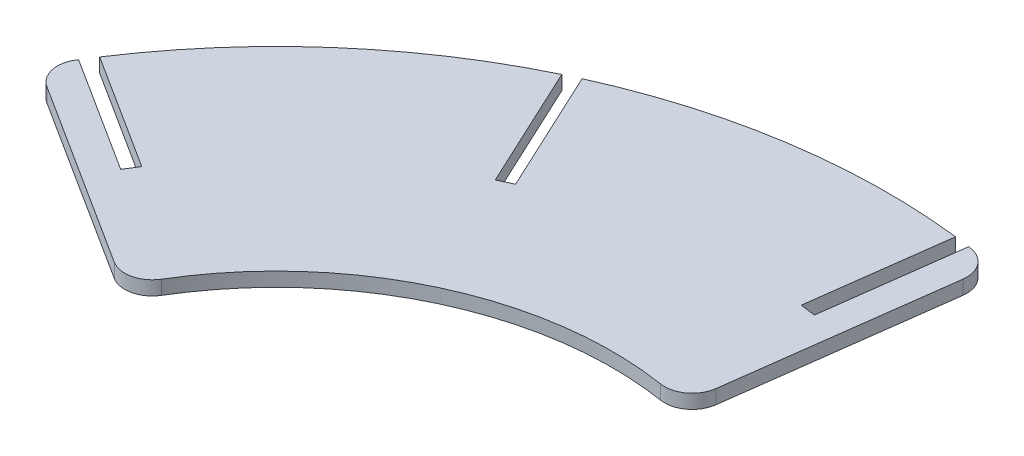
ISO-10303-21;
HEADER;
FILE_DESCRIPTION(('STEP AP214'),'2;1');
FILE_NAME('part.step','',(''),(''),'','','');
FILE_SCHEMA(('AUTOMOTIVE_DESIGN { 1 0 10303 214 1 1 1 1 }'));
ENDSEC;
DATA;
#1=APPLICATION_CONTEXT('core data for automotive mechanical design processes');
#2=APPLICATION_PROTOCOL_DEFINITION('international standard','automotive_design',2000,#1);
#3=PRODUCT_CONTEXT('',#1,'mechanical');
#4=PRODUCT('Part','Part','',(#3));
#5=PRODUCT_RELATED_PRODUCT_CATEGORY('part','',(#4));
#6=PRODUCT_DEFINITION_FORMATION('','',#4);
#7=PRODUCT_DEFINITION_CONTEXT('part definition',#1,'design');
#8=PRODUCT_DEFINITION('design','',#6,#7);
#9=PRODUCT_DEFINITION_SHAPE('','',#8);
#10=(LENGTH_UNIT() NAMED_UNIT(*) SI_UNIT(.MILLI.,.METRE.));
#11=(NAMED_UNIT(*) PLANE_ANGLE_UNIT() SI_UNIT($,.RADIAN.));
#12=(NAMED_UNIT(*) SI_UNIT($,.STERADIAN.) SOLID_ANGLE_UNIT());
#13=UNCERTAINTY_MEASURE_WITH_UNIT(LENGTH_MEASURE(1.E-05),#10,'distance_accuracy_value','');
#14=(GEOMETRIC_REPRESENTATION_CONTEXT(3) GLOBAL_UNCERTAINTY_ASSIGNED_CONTEXT((#13)) GLOBAL_UNIT_ASSIGNED_CONTEXT((#10,
#11,#12)) REPRESENTATION_CONTEXT('',''));
#15=CARTESIAN_POINT('',(0.,0.,0.));
#16=DIRECTION('',(0.,0.,1.));
#17=DIRECTION('',(1.,0.,0.));
#18=AXIS2_PLACEMENT_3D('',#15,#16,#17);
#19=CARTESIAN_POINT('',(-205.439804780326,23.,322.475898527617));
#20=DIRECTION('',(-0.537299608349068,0.,0.843391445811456));
#21=DIRECTION('',(0.843391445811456,0.,0.537299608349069));
#22=AXIS2_PLACEMENT_3D('',#19,#20,#21);
#23=PLANE('',#22);
#24=DIRECTION('',(-0.843391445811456,0.,-0.537299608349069));
#25=VECTOR('',#24,1.);
#26=CARTESIAN_POINT('',(-205.439804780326,0.,322.475898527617));
#27=LINE('',#26,#25);
#28=CARTESIAN_POINT('',(-683.022919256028,0.,18.2218992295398));
#29=VERTEX_POINT('',#28);
#30=CARTESIAN_POINT('',(-872.792066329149,0.,-102.674380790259));
#31=VERTEX_POINT('',#30);
#32=EDGE_CURVE('E189',#29,#31,#27,.T.);
#33=ORIENTED_EDGE('',*,*,#32,.T.);
#34=DIRECTION('',(0.,-1.,0.));
#35=VECTOR('',#34,1.);
#36=CARTESIAN_POINT('',(-872.792066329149,23.,-102.674380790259));
#37=LINE('',#36,#35);
#38=CARTESIAN_POINT('',(-872.792066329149,23.,-102.674380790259));
#39=VERTEX_POINT('',#38);
#40=EDGE_CURVE('E173',#39,#31,#37,.T.);
#41=ORIENTED_EDGE('',*,*,#40,.F.);
#42=DIRECTION('',(-0.843391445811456,0.,-0.537299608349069));
#43=VECTOR('',#42,1.);
#44=CARTESIAN_POINT('',(-205.439804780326,23.,322.475898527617));
#45=LINE('',#44,#43);
#46=CARTESIAN_POINT('',(-683.022919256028,23.,18.2218992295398));
#47=VERTEX_POINT('',#46);
#48=EDGE_CURVE('E176',#47,#39,#45,.T.);
#49=ORIENTED_EDGE('',*,*,#48,.F.);
#50=DIRECTION('',(0.,-1.,0.));
#51=VECTOR('',#50,1.);
#52=CARTESIAN_POINT('',(-683.022919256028,23.,18.2218992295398));
#53=LINE('',#52,#51);
#54=EDGE_CURVE('E289',#47,#29,#53,.T.);
#55=ORIENTED_EDGE('',*,*,#54,.T.);
#56=EDGE_LOOP('',(#33,#41,#49,#55));
#57=FACE_BOUND('',#56,.T.);
#58=ADVANCED_FACE('F34',(#57),#23,.F.);
#59=CARTESIAN_POINT('',(-22.750267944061,23.,424.040856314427));
#60=DIRECTION('',(0.,-1.,0.));
#61=DIRECTION('',(0.,0.,-1.));
#62=AXIS2_PLACEMENT_3D('',#59,#60,#61);
#63=CYLINDRICAL_SURFACE('',#62,1000.);
#64=CARTESIAN_POINT('',(-22.750267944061,0.,424.040856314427));
#65=DIRECTION('',(0.,1.,0.));
#66=DIRECTION('',(0.,0.,1.));
#67=AXIS2_PLACEMENT_3D('',#64,#65,#66);
#68=CIRCLE('',#67,1000.);
#69=CARTESIAN_POINT('',(-874.476934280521,0.,-99.9454849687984));
#70=VERTEX_POINT('',#69);
#71=EDGE_CURVE('E254',#31,#70,#68,.T.);
#72=ORIENTED_EDGE('',*,*,#71,.T.);
#73=DIRECTION('',(0.,-1.,0.));
#74=VECTOR('',#73,1.);
#75=CARTESIAN_POINT('',(-874.476934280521,23.,-99.9454849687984));
#76=LINE('',#75,#74);
#77=CARTESIAN_POINT('',(-874.476934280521,23.,-99.9454849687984));
#78=VERTEX_POINT('',#77);
#79=EDGE_CURVE('E11',#70,#78,#76,.F.);
#80=ORIENTED_EDGE('',*,*,#79,.T.);
#81=CARTESIAN_POINT('',(-22.750267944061,23.,424.040856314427));
#82=DIRECTION('',(0.,1.,0.));
#83=DIRECTION('',(0.,0.,1.));
#84=AXIS2_PLACEMENT_3D('',#81,#82,#83);
#85=CIRCLE('',#84,1000.);
#86=EDGE_CURVE('E169',#39,#78,#85,.T.);
#87=ORIENTED_EDGE('',*,*,#86,.F.);
#88=ORIENTED_EDGE('',*,*,#40,.T.);
#89=EDGE_LOOP('',(#72,#80,#87,#88));
#90=FACE_BOUND('',#89,.T.);
#91=ADVANCED_FACE('F171',(#90),#63,.T.);
#92=CARTESIAN_POINT('',(-230.961536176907,23.,362.536992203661));
#93=DIRECTION('',(-0.537299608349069,0.,0.843391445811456));
#94=DIRECTION('',(0.843391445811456,0.,0.537299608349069));
#95=AXIS2_PLACEMENT_3D('',#92,#93,#94);
#96=PLANE('',#95);
#97=DIRECTION('',(-0.843391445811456,0.,-0.537299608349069));
#98=VECTOR('',#97,1.);
#99=CARTESIAN_POINT('',(-230.961536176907,0.,362.536992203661));
#100=LINE('',#99,#98);
#101=CARTESIAN_POINT('',(-556.646664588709,0.,155.052682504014));
#102=VERTEX_POINT('',#101);
#103=CARTESIAN_POINT('',(-860.327716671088,0.,-38.4134845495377));
#104=VERTEX_POINT('',#103);
#105=EDGE_CURVE('E249',#102,#104,#100,.T.);
#106=ORIENTED_EDGE('',*,*,#105,.F.);
#107=DIRECTION('',(0.,-1.,0.));
#108=VECTOR('',#107,1.);
#109=CARTESIAN_POINT('',(-556.646664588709,23.,155.052682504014));
#110=LINE('',#109,#108);
#111=CARTESIAN_POINT('',(-556.646664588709,23.,155.052682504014));
#112=VERTEX_POINT('',#111);
#113=EDGE_CURVE('E227',#102,#112,#110,.F.);
#114=ORIENTED_EDGE('',*,*,#113,.T.);
#115=DIRECTION('',(-0.843391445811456,0.,-0.537299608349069));
#116=VECTOR('',#115,1.);
#117=CARTESIAN_POINT('',(-230.961536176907,23.,362.536992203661));
#118=LINE('',#117,#116);
#119=CARTESIAN_POINT('',(-860.327716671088,23.,-38.4134845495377));
#120=VERTEX_POINT('',#119);
#121=EDGE_CURVE('E175',#112,#120,#118,.T.);
#122=ORIENTED_EDGE('',*,*,#121,.T.);
#123=DIRECTION('',(0.,1.,0.));
#124=VECTOR('',#123,1.);
#125=CARTESIAN_POINT('',(-860.327716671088,0.,-38.4134845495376));
#126=LINE('',#125,#124);
#127=EDGE_CURVE('E224',#120,#104,#126,.F.);
#128=ORIENTED_EDGE('',*,*,#127,.T.);
#129=EDGE_LOOP('',(#106,#114,#122,#128));
#130=FACE_BOUND('',#129,.T.);
#131=ADVANCED_FACE('F252',(#130),#96,.T.);
#132=CARTESIAN_POINT('',(-22.750267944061,23.,424.040856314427));
#133=DIRECTION('',(0.,-1.,0.));
#134=DIRECTION('',(0.,0.,-1.));
#135=AXIS2_PLACEMENT_3D('',#132,#133,#134);
#136=CYLINDRICAL_SURFACE('',#135,550.);
#137=CARTESIAN_POINT('',(-22.750267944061,23.,424.040856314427));
#138=DIRECTION('',(0.,1.,0.));
#139=DIRECTION('',(0.,0.,1.));
#140=AXIS2_PLACEMENT_3D('',#137,#138,#139);
#141=CIRCLE('',#140,550.);
#142=CARTESIAN_POINT('',(62.7632458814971,23.,-119.270692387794));
#143=VERTEX_POINT('',#142);
#144=CARTESIAN_POINT('',(-493.918087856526,23.,140.314076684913));
#145=VERTEX_POINT('',#144);
#146=EDGE_CURVE('E232',#143,#145,#141,.T.);
#147=ORIENTED_EDGE('',*,*,#146,.T.);
#148=DIRECTION('',(0.,-1.,0.));
#149=VECTOR('',#148,1.);
#150=CARTESIAN_POINT('',(-493.918087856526,23.,140.314076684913));
#151=LINE('',#150,#149);
#152=CARTESIAN_POINT('',(-493.918087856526,0.,140.314076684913));
#153=VERTEX_POINT('',#152);
#154=EDGE_CURVE('E217',#145,#153,#151,.T.);
#155=ORIENTED_EDGE('',*,*,#154,.T.);
#156=CARTESIAN_POINT('',(-22.750267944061,0.,424.040856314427));
#157=DIRECTION('',(0.,1.,0.));
#158=DIRECTION('',(0.,0.,1.));
#159=AXIS2_PLACEMENT_3D('',#156,#157,#158);
#160=CIRCLE('',#159,550.);
#161=CARTESIAN_POINT('',(62.7632458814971,0.,-119.270692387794));
#162=VERTEX_POINT('',#161);
#163=EDGE_CURVE('E250',#162,#153,#160,.T.);
#164=ORIENTED_EDGE('',*,*,#163,.F.);
#165=DIRECTION('',(0.,-1.,0.));
#166=VECTOR('',#165,1.);
#167=CARTESIAN_POINT('',(62.7632458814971,23.,-119.270692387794));
#168=LINE('',#167,#166);
#169=EDGE_CURVE('E213',#162,#143,#168,.F.);
#170=ORIENTED_EDGE('',*,*,#169,.T.);
#171=EDGE_LOOP('',(#147,#155,#164,#170));
#172=FACE_BOUND('',#171,.T.);
#173=ADVANCED_FACE('F238',(#172),#136,.F.);
#174=CARTESIAN_POINT('',(91.9989467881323,23.,12.1118911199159));
#175=DIRECTION('',(-0.991444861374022,0.,-0.130526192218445));
#176=DIRECTION('',(-0.130526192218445,0.,0.991444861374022));
#177=AXIS2_PLACEMENT_3D('',#174,#175,#176);
#178=PLANE('',#177);
#179=DIRECTION('',(0.130526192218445,0.,-0.991444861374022));
#180=VECTOR('',#179,1.);
#181=CARTESIAN_POINT('',(91.9989467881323,23.,12.1118911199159));
#182=LINE('',#181,#180);
#183=CARTESIAN_POINT('',(114.374824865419,23.,-157.8497768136));
#184=VERTEX_POINT('',#183);
#185=CARTESIAN_POINT('',(161.373560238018,23.,-514.840614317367));
#186=VERTEX_POINT('',#185);
#187=EDGE_CURVE('E242',#184,#186,#182,.T.);
#188=ORIENTED_EDGE('',*,*,#187,.F.);
#189=DIRECTION('',(0.,1.,0.));
#190=VECTOR('',#189,1.);
#191=CARTESIAN_POINT('',(114.374824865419,0.,-157.8497768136));
#192=LINE('',#191,#190);
#193=CARTESIAN_POINT('',(114.374824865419,0.,-157.8497768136));
#194=VERTEX_POINT('',#193);
#195=EDGE_CURVE('E208',#184,#194,#192,.F.);
#196=ORIENTED_EDGE('',*,*,#195,.T.);
#197=DIRECTION('',(0.130526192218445,0.,-0.991444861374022));
#198=VECTOR('',#197,1.);
#199=CARTESIAN_POINT('',(91.9989467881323,0.,12.1118911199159));
#200=LINE('',#199,#198);
#201=CARTESIAN_POINT('',(161.373560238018,0.,-514.840614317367));
#202=VERTEX_POINT('',#201);
#203=EDGE_CURVE('E256',#194,#202,#200,.T.);
#204=ORIENTED_EDGE('',*,*,#203,.T.);
#205=DIRECTION('',(0.,-1.,0.));
#206=VECTOR('',#205,1.);
#207=CARTESIAN_POINT('',(161.373560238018,23.,-514.840614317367));
#208=LINE('',#207,#206);
#209=EDGE_CURVE('E203',#202,#186,#208,.F.);
#210=ORIENTED_EDGE('',*,*,#209,.T.);
#211=EDGE_LOOP('',(#188,#196,#204,#210));
#212=FACE_BOUND('',#211,.T.);
#213=ADVANCED_FACE('F425',(#212),#178,.F.);
#214=CARTESIAN_POINT('',(-22.750267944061,23.,424.040856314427));
#215=DIRECTION('',(0.,-1.,0.));
#216=DIRECTION('',(0.,0.,-1.));
#217=AXIS2_PLACEMENT_3D('',#214,#215,#216);
#218=CYLINDRICAL_SURFACE('',#217,1000.);
#219=CARTESIAN_POINT('',(-22.750267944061,23.,424.040856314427));
#220=DIRECTION('',(0.,1.,0.));
#221=DIRECTION('',(0.,0.,1.));
#222=AXIS2_PLACEMENT_3D('',#219,#220,#221);
#223=CIRCLE('',#222,1000.);
#224=CARTESIAN_POINT('',(123.332255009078,23.,-565.231551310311));
#225=VERTEX_POINT('',#224);
#226=CARTESIAN_POINT('',(120.158787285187,23.,-565.694968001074));
#227=VERTEX_POINT('',#226);
#228=EDGE_CURVE('E559',#225,#227,#223,.T.);
#229=ORIENTED_EDGE('',*,*,#228,.F.);
#230=DIRECTION('',(0.,-1.,0.));
#231=VECTOR('',#230,1.);
#232=CARTESIAN_POINT('',(123.332255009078,23.,-565.231551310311));
#233=LINE('',#232,#231);
#234=CARTESIAN_POINT('',(123.332255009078,0.,-565.231551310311));
#235=VERTEX_POINT('',#234);
#236=EDGE_CURVE('E190',#225,#235,#233,.T.);
#237=ORIENTED_EDGE('',*,*,#236,.T.);
#238=CARTESIAN_POINT('',(-22.750267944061,0.,424.040856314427));
#239=DIRECTION('',(0.,1.,0.));
#240=DIRECTION('',(0.,0.,1.));
#241=AXIS2_PLACEMENT_3D('',#238,#239,#240);
#242=CIRCLE('',#241,1000.);
#243=CARTESIAN_POINT('',(120.158787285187,0.,-565.694968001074));
#244=VERTEX_POINT('',#243);
#245=EDGE_CURVE('E262',#235,#244,#242,.T.);
#246=ORIENTED_EDGE('',*,*,#245,.T.);
#247=DIRECTION('',(0.,-1.,0.));
#248=VECTOR('',#247,1.);
#249=CARTESIAN_POINT('',(120.158787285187,23.,-565.694968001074));
#250=LINE('',#249,#248);
#251=EDGE_CURVE('E191',#227,#244,#250,.T.);
#252=ORIENTED_EDGE('',*,*,#251,.F.);
#253=EDGE_LOOP('',(#229,#237,#246,#252));
#254=FACE_BOUND('',#253,.T.);
#255=ADVANCED_FACE('F453',(#254),#218,.T.);
#256=CARTESIAN_POINT('',(44.9053158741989,23.,5.91189698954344));
#257=DIRECTION('',(-0.991444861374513,0.,-0.130526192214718));
#258=DIRECTION('',(-0.130526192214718,0.,0.991444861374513));
#259=AXIS2_PLACEMENT_3D('',#256,#257,#258);
#260=PLANE('',#259);
#261=DIRECTION('',(0.130526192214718,0.,-0.991444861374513));
#262=VECTOR('',#261,1.);
#263=CARTESIAN_POINT('',(44.9053158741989,0.,5.91189698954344));
#264=LINE('',#263,#262);
#265=CARTESIAN_POINT('',(90.7894543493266,0.,-342.612736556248));
#266=VERTEX_POINT('',#265);
#267=EDGE_CURVE('E264',#266,#244,#264,.T.);
#268=ORIENTED_EDGE('',*,*,#267,.F.);
#269=DIRECTION('',(0.,-1.,0.));
#270=VECTOR('',#269,1.);
#271=CARTESIAN_POINT('',(90.7894543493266,23.,-342.612736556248));
#272=LINE('',#271,#270);
#273=CARTESIAN_POINT('',(90.7894543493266,23.,-342.612736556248));
#274=VERTEX_POINT('',#273);
#275=EDGE_CURVE('E197',#274,#266,#272,.T.);
#276=ORIENTED_EDGE('',*,*,#275,.F.);
#277=DIRECTION('',(0.130526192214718,0.,-0.991444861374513));
#278=VECTOR('',#277,1.);
#279=CARTESIAN_POINT('',(44.9053158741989,23.,5.91189698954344));
#280=LINE('',#279,#278);
#281=EDGE_CURVE('E561',#274,#227,#280,.T.);
#282=ORIENTED_EDGE('',*,*,#281,.T.);
#283=ORIENTED_EDGE('',*,*,#251,.T.);
#284=EDGE_LOOP('',(#268,#276,#282,#283));
#285=FACE_BOUND('',#284,.T.);
#286=ADVANCED_FACE('F319',(#285),#260,.T.);
#287=CARTESIAN_POINT('',(45.8841384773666,23.,-348.524633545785));
#288=DIRECTION('',(0.13052619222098,0.,-0.991444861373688));
#289=DIRECTION('',(-0.991444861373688,0.,-0.13052619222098));
#290=AXIS2_PLACEMENT_3D('',#287,#288,#289);
#291=PLANE('',#290);
#292=DIRECTION('',(0.991444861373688,0.,0.13052619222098));
#293=VECTOR('',#292,1.);
#294=CARTESIAN_POINT('',(45.8841384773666,0.,-348.524633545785));
#295=LINE('',#294,#293);
#296=CARTESIAN_POINT('',(66.0033328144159,0.,-345.875891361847));
#297=VERTEX_POINT('',#296);
#298=EDGE_CURVE('E267',#297,#266,#295,.T.);
#299=ORIENTED_EDGE('',*,*,#298,.F.);
#300=DIRECTION('',(0.,-1.,0.));
#301=VECTOR('',#300,1.);
#302=CARTESIAN_POINT('',(66.0033328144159,23.,-345.875891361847));
#303=LINE('',#302,#301);
#304=CARTESIAN_POINT('',(66.0033328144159,23.,-345.875891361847));
#305=VERTEX_POINT('',#304);
#306=EDGE_CURVE('E308',#305,#297,#303,.T.);
#307=ORIENTED_EDGE('',*,*,#306,.F.);
#308=DIRECTION('',(0.991444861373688,0.,0.13052619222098));
#309=VECTOR('',#308,1.);
#310=CARTESIAN_POINT('',(45.8841384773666,23.,-348.524633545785));
#311=LINE('',#310,#309);
#312=EDGE_CURVE('E315',#305,#274,#311,.T.);
#313=ORIENTED_EDGE('',*,*,#312,.T.);
#314=ORIENTED_EDGE('',*,*,#275,.T.);
#315=EDGE_LOOP('',(#299,#307,#313,#314));
#316=FACE_BOUND('',#315,.T.);
#317=ADVANCED_FACE('F313',(#316),#291,.T.);
#318=CARTESIAN_POINT('',(20.1191943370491,23.,2.64874218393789));
#319=DIRECTION('',(-0.991444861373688,0.,-0.130526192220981));
#320=DIRECTION('',(-0.130526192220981,0.,0.991444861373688));
#321=AXIS2_PLACEMENT_3D('',#318,#319,#320);
#322=PLANE('',#321);
#323=DIRECTION('',(0.130526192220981,0.,-0.991444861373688));
#324=VECTOR('',#323,1.);
#325=CARTESIAN_POINT('',(20.1191943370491,0.,2.64874218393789));
#326=LINE('',#325,#324);
#327=CARTESIAN_POINT('',(95.3726657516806,0.,-568.958122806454));
#328=VERTEX_POINT('',#327);
#329=EDGE_CURVE('E270',#297,#328,#326,.T.);
#330=ORIENTED_EDGE('',*,*,#329,.T.);
#331=DIRECTION('',(0.,-1.,0.));
#332=VECTOR('',#331,1.);
#333=CARTESIAN_POINT('',(95.3726657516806,23.,-568.958122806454));
#334=LINE('',#333,#332);
#335=CARTESIAN_POINT('',(95.3726657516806,23.,-568.958122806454));
#336=VERTEX_POINT('',#335);
#337=EDGE_CURVE('E305',#336,#328,#334,.T.);
#338=ORIENTED_EDGE('',*,*,#337,.F.);
#339=DIRECTION('',(0.130526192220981,0.,-0.991444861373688));
#340=VECTOR('',#339,1.);
#341=CARTESIAN_POINT('',(20.1191943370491,23.,2.64874218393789));
#342=LINE('',#341,#340);
#343=EDGE_CURVE('E336',#305,#336,#342,.T.);
#344=ORIENTED_EDGE('',*,*,#343,.F.);
#345=ORIENTED_EDGE('',*,*,#306,.T.);
#346=EDGE_LOOP('',(#330,#338,#344,#345));
#347=FACE_BOUND('',#346,.T.);
#348=ADVANCED_FACE('F326',(#347),#322,.F.);
#349=CARTESIAN_POINT('',(-22.750267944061,23.,424.040856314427));
#350=DIRECTION('',(0.,-1.,0.));
#351=DIRECTION('',(0.,0.,-1.));
#352=AXIS2_PLACEMENT_3D('',#349,#350,#351);
#353=CYLINDRICAL_SURFACE('',#352,1000.);
#354=CARTESIAN_POINT('',(-22.750267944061,0.,424.040856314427));
#355=DIRECTION('',(0.,1.,0.));
#356=DIRECTION('',(0.,0.,1.));
#357=AXIS2_PLACEMENT_3D('',#354,#355,#356);
#358=CIRCLE('',#357,1000.);
#359=CARTESIAN_POINT('',(-434.00666400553,0.,-487.478850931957));
#360=VERTEX_POINT('',#359);
#361=EDGE_CURVE('E272',#328,#360,#358,.T.);
#362=ORIENTED_EDGE('',*,*,#361,.T.);
#363=DIRECTION('',(0.,-1.,0.));
#364=VECTOR('',#363,1.);
#365=CARTESIAN_POINT('',(-434.00666400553,23.,-487.478850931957));
#366=LINE('',#365,#364);
#367=CARTESIAN_POINT('',(-434.00666400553,23.,-487.478850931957));
#368=VERTEX_POINT('',#367);
#369=EDGE_CURVE('E303',#368,#360,#366,.T.);
#370=ORIENTED_EDGE('',*,*,#369,.F.);
#371=CARTESIAN_POINT('',(-22.750267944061,23.,424.040856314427));
#372=DIRECTION('',(0.,1.,0.));
#373=DIRECTION('',(0.,0.,1.));
#374=AXIS2_PLACEMENT_3D('',#371,#372,#373);
#375=CIRCLE('',#374,1000.);
#376=EDGE_CURVE('E332',#336,#368,#375,.T.);
#377=ORIENTED_EDGE('',*,*,#376,.F.);
#378=ORIENTED_EDGE('',*,*,#337,.T.);
#379=EDGE_LOOP('',(#362,#370,#377,#378));
#380=FACE_BOUND('',#379,.T.);
#381=ADVANCED_FACE('F330',(#380),#353,.T.);
#382=CARTESIAN_POINT('',(-169.775152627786,23.,79.1674538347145));
#383=DIRECTION('',(-0.906307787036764,0.,0.422618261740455));
#384=DIRECTION('',(0.422618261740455,0.,0.906307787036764));
#385=AXIS2_PLACEMENT_3D('',#382,#383,#384);
#386=PLANE('',#385);
#387=DIRECTION('',(-0.422618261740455,0.,-0.906307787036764));
#388=VECTOR('',#387,1.);
#389=CARTESIAN_POINT('',(-169.775152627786,0.,79.1674538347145));
#390=LINE('',#389,#388);
#391=CARTESIAN_POINT('',(-338.914512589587,0.,-283.553074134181));
#392=VERTEX_POINT('',#391);
#393=EDGE_CURVE('E275',#392,#360,#390,.T.);
#394=ORIENTED_EDGE('',*,*,#393,.F.);
#395=DIRECTION('',(0.,-1.,0.));
#396=VECTOR('',#395,1.);
#397=CARTESIAN_POINT('',(-338.914512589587,23.,-283.553074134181));
#398=LINE('',#397,#396);
#399=CARTESIAN_POINT('',(-338.914512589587,23.,-283.553074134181));
#400=VERTEX_POINT('',#399);
#401=EDGE_CURVE('E301',#400,#392,#398,.T.);
#402=ORIENTED_EDGE('',*,*,#401,.F.);
#403=DIRECTION('',(-0.422618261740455,0.,-0.906307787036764));
#404=VECTOR('',#403,1.);
#405=CARTESIAN_POINT('',(-169.775152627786,23.,79.1674538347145));
#406=LINE('',#405,#404);
#407=EDGE_CURVE('E335',#400,#368,#406,.T.);
#408=ORIENTED_EDGE('',*,*,#407,.T.);
#409=ORIENTED_EDGE('',*,*,#369,.T.);
#410=EDGE_LOOP('',(#394,#402,#408,#409));
#411=FACE_BOUND('',#410,.T.);
#412=ADVANCED_FACE('F507',(#411),#386,.T.);
#413=CARTESIAN_POINT('',(-169.139359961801,23.,-362.720527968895));
#414=DIRECTION('',(0.422618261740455,0.,0.906307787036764));
#415=DIRECTION('',(0.906307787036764,0.,-0.422618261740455));
#416=AXIS2_PLACEMENT_3D('',#413,#414,#415);
#417=PLANE('',#416);
#418=DIRECTION('',(-0.906307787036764,0.,0.422618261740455));
#419=VECTOR('',#418,1.);
#420=CARTESIAN_POINT('',(-169.139359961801,0.,-362.720527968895));
#421=LINE('',#420,#419);
#422=CARTESIAN_POINT('',(-361.572207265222,0.,-272.987617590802));
#423=VERTEX_POINT('',#422);
#424=EDGE_CURVE('E278',#392,#423,#421,.T.);
#425=ORIENTED_EDGE('',*,*,#424,.T.);
#426=DIRECTION('',(0.,-1.,0.));
#427=VECTOR('',#426,1.);
#428=CARTESIAN_POINT('',(-361.572207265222,23.,-272.987617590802));
#429=LINE('',#428,#427);
#430=CARTESIAN_POINT('',(-361.572207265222,23.,-272.987617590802));
#431=VERTEX_POINT('',#430);
#432=EDGE_CURVE('E298',#431,#423,#429,.T.);
#433=ORIENTED_EDGE('',*,*,#432,.F.);
#434=DIRECTION('',(-0.906307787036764,0.,0.422618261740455));
#435=VECTOR('',#434,1.);
#436=CARTESIAN_POINT('',(-169.139359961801,23.,-362.720527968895));
#437=LINE('',#436,#435);
#438=EDGE_CURVE('E338',#400,#431,#437,.T.);
#439=ORIENTED_EDGE('',*,*,#438,.F.);
#440=ORIENTED_EDGE('',*,*,#401,.T.);
#441=EDGE_LOOP('',(#425,#433,#439,#440));
#442=FACE_BOUND('',#441,.T.);
#443=ADVANCED_FACE('F497',(#442),#417,.F.);
#444=CARTESIAN_POINT('',(-192.432847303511,23.,89.7329103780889));
#445=DIRECTION('',(-0.906307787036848,0.,0.422618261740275));
#446=DIRECTION('',(0.422618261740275,0.,0.906307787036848));
#447=AXIS2_PLACEMENT_3D('',#444,#445,#446);
#448=PLANE('',#447);
#449=DIRECTION('',(-0.422618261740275,0.,-0.906307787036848));
#450=VECTOR('',#449,1.);
#451=CARTESIAN_POINT('',(-192.432847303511,0.,89.7329103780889));
#452=LINE('',#451,#450);
#453=CARTESIAN_POINT('',(-456.66435868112,0.,-476.913394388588));
#454=VERTEX_POINT('',#453);
#455=EDGE_CURVE('E280',#423,#454,#452,.T.);
#456=ORIENTED_EDGE('',*,*,#455,.T.);
#457=DIRECTION('',(0.,-1.,0.));
#458=VECTOR('',#457,1.);
#459=CARTESIAN_POINT('',(-456.66435868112,23.,-476.913394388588));
#460=LINE('',#459,#458);
#461=CARTESIAN_POINT('',(-456.66435868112,23.,-476.913394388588));
#462=VERTEX_POINT('',#461);
#463=EDGE_CURVE('E295',#462,#454,#460,.T.);
#464=ORIENTED_EDGE('',*,*,#463,.F.);
#465=DIRECTION('',(-0.422618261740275,0.,-0.906307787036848));
#466=VECTOR('',#465,1.);
#467=CARTESIAN_POINT('',(-192.432847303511,23.,89.7329103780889));
#468=LINE('',#467,#466);
#469=EDGE_CURVE('E344',#431,#462,#468,.T.);
#470=ORIENTED_EDGE('',*,*,#469,.F.);
#471=ORIENTED_EDGE('',*,*,#432,.T.);
#472=EDGE_LOOP('',(#456,#464,#470,#471));
#473=FACE_BOUND('',#472,.T.);
#474=ADVANCED_FACE('F488',(#473),#448,.F.);
#475=CARTESIAN_POINT('',(-22.750267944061,23.,424.040856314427));
#476=DIRECTION('',(0.,-1.,0.));
#477=DIRECTION('',(0.,0.,-1.));
#478=AXIS2_PLACEMENT_3D('',#475,#476,#477);
#479=CYLINDRICAL_SURFACE('',#478,1000.);
#480=CARTESIAN_POINT('',(-22.750267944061,0.,424.040856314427));
#481=DIRECTION('',(0.,1.,0.));
#482=DIRECTION('',(0.,0.,1.));
#483=AXIS2_PLACEMENT_3D('',#480,#481,#482);
#484=CIRCLE('',#483,1000.);
#485=CARTESIAN_POINT('',(-859.359576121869,0.,-123.759166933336));
#486=VERTEX_POINT('',#485);
#487=EDGE_CURVE('E282',#454,#486,#484,.T.);
#488=ORIENTED_EDGE('',*,*,#487,.T.);
#489=DIRECTION('',(0.,-1.,0.));
#490=VECTOR('',#489,1.);
#491=CARTESIAN_POINT('',(-859.359576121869,23.,-123.759166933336));
#492=LINE('',#491,#490);
#493=CARTESIAN_POINT('',(-859.359576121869,23.,-123.759166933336));
#494=VERTEX_POINT('',#493);
#495=EDGE_CURVE('E293',#494,#486,#492,.T.);
#496=ORIENTED_EDGE('',*,*,#495,.F.);
#497=CARTESIAN_POINT('',(-22.750267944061,23.,424.040856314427));
#498=DIRECTION('',(0.,1.,0.));
#499=DIRECTION('',(0.,0.,1.));
#500=AXIS2_PLACEMENT_3D('',#497,#498,#499);
#501=CIRCLE('',#500,1000.);
#502=EDGE_CURVE('E346',#462,#494,#501,.T.);
#503=ORIENTED_EDGE('',*,*,#502,.F.);
#504=ORIENTED_EDGE('',*,*,#463,.T.);
#505=EDGE_LOOP('',(#488,#496,#503,#504));
#506=FACE_BOUND('',#505,.T.);
#507=ADVANCED_FACE('F359',(#506),#479,.T.);
#508=CARTESIAN_POINT('',(-192.00731457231,23.,301.391112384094));
#509=DIRECTION('',(-0.537299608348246,0.,0.84339144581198));
#510=DIRECTION('',(0.84339144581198,0.,0.537299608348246));
#511=AXIS2_PLACEMENT_3D('',#508,#509,#510);
#512=PLANE('',#511);
#513=DIRECTION('',(-0.84339144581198,0.,-0.537299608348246));
#514=VECTOR('',#513,1.);
#515=CARTESIAN_POINT('',(-192.00731457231,0.,301.391112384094));
#516=LINE('',#515,#514);
#517=CARTESIAN_POINT('',(-669.590429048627,0.,-2.86288691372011));
#518=VERTEX_POINT('',#517);
#519=EDGE_CURVE('E285',#518,#486,#516,.T.);
#520=ORIENTED_EDGE('',*,*,#519,.F.);
#521=DIRECTION('',(0.,-1.,0.));
#522=VECTOR('',#521,1.);
#523=CARTESIAN_POINT('',(-669.590429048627,23.,-2.86288691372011));
#524=LINE('',#523,#522);
#525=CARTESIAN_POINT('',(-669.590429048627,23.,-2.86288691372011));
#526=VERTEX_POINT('',#525);
#527=EDGE_CURVE('E291',#526,#518,#524,.T.);
#528=ORIENTED_EDGE('',*,*,#527,.F.);
#529=DIRECTION('',(-0.84339144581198,0.,-0.537299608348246));
#530=VECTOR('',#529,1.);
#531=CARTESIAN_POINT('',(-192.00731457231,23.,301.391112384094));
#532=LINE('',#531,#530);
#533=EDGE_CURVE('E348',#526,#494,#532,.T.);
#534=ORIENTED_EDGE('',*,*,#533,.T.);
#535=ORIENTED_EDGE('',*,*,#495,.T.);
#536=EDGE_LOOP('',(#520,#528,#534,#535));
#537=FACE_BOUND('',#536,.T.);
#538=ADVANCED_FACE('F353',(#537),#512,.T.);
#539=CARTESIAN_POINT('',(-477.583114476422,23.,-304.253999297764));
#540=DIRECTION('',(0.843391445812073,0.,0.537299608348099));
#541=DIRECTION('',(0.537299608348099,0.,-0.843391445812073));
#542=AXIS2_PLACEMENT_3D('',#539,#540,#541);
#543=PLANE('',#542);
#544=DIRECTION('',(-0.537299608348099,0.,0.843391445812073));
#545=VECTOR('',#544,1.);
#546=CARTESIAN_POINT('',(-477.583114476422,0.,-304.253999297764));
#547=LINE('',#546,#545);
#548=EDGE_CURVE('E186',#518,#29,#547,.T.);
#549=ORIENTED_EDGE('',*,*,#548,.T.);
#550=ORIENTED_EDGE('',*,*,#54,.F.);
#551=DIRECTION('',(-0.537299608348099,0.,0.843391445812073));
#552=VECTOR('',#551,1.);
#553=CARTESIAN_POINT('',(-477.583114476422,23.,-304.253999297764));
#554=LINE('',#553,#552);
#555=EDGE_CURVE('E182',#526,#47,#554,.T.);
#556=ORIENTED_EDGE('',*,*,#555,.F.);
#557=ORIENTED_EDGE('',*,*,#527,.T.);
#558=EDGE_LOOP('',(#549,#550,#556,#557));
#559=FACE_BOUND('',#558,.T.);
#560=ADVANCED_FACE('F364',(#559),#543,.F.);
#561=CARTESIAN_POINT('',(0.,23.,0.));
#562=DIRECTION('',(0.,1.,0.));
#563=DIRECTION('',(0.,0.,1.));
#564=AXIS2_PLACEMENT_3D('',#561,#562,#563);
#565=PLANE('',#564);
#566=ORIENTED_EDGE('',*,*,#121,.F.);
#567=CARTESIAN_POINT('',(-532.468182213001,23.,117.100067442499));
#568=DIRECTION('',(0.,1.,0.));
#569=DIRECTION('',(0.,0.,1.));
#570=AXIS2_PLACEMENT_3D('',#567,#568,#569);
#571=CIRCLE('',#570,45.);
#572=EDGE_CURVE('E42',#112,#145,#571,.T.);
#573=ORIENTED_EDGE('',*,*,#572,.T.);
#574=ORIENTED_EDGE('',*,*,#146,.F.);
#575=CARTESIAN_POINT('',(69.7598061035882,23.,-163.723455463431));
#576=DIRECTION('',(0.,1.,0.));
#577=DIRECTION('',(0.,0.,1.));
#578=AXIS2_PLACEMENT_3D('',#575,#576,#577);
#579=CIRCLE('',#578,45.);
#580=EDGE_CURVE('E215',#143,#184,#579,.T.);
#581=ORIENTED_EDGE('',*,*,#580,.T.);
#582=ORIENTED_EDGE('',*,*,#187,.T.);
#583=CARTESIAN_POINT('',(116.758541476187,23.,-520.714292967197));
#584=DIRECTION('',(0.,1.,0.));
#585=DIRECTION('',(0.,0.,1.));
#586=AXIS2_PLACEMENT_3D('',#583,#584,#585);
#587=CIRCLE('',#586,45.);
#588=EDGE_CURVE('E206',#186,#225,#587,.T.);
#589=ORIENTED_EDGE('',*,*,#588,.T.);
#590=ORIENTED_EDGE('',*,*,#228,.T.);
#591=ORIENTED_EDGE('',*,*,#281,.F.);
#592=ORIENTED_EDGE('',*,*,#312,.F.);
#593=ORIENTED_EDGE('',*,*,#343,.T.);
#594=ORIENTED_EDGE('',*,*,#376,.T.);
#595=ORIENTED_EDGE('',*,*,#407,.F.);
#596=ORIENTED_EDGE('',*,*,#438,.T.);
#597=ORIENTED_EDGE('',*,*,#469,.T.);
#598=ORIENTED_EDGE('',*,*,#502,.T.);
#599=ORIENTED_EDGE('',*,*,#533,.F.);
#600=ORIENTED_EDGE('',*,*,#555,.T.);
#601=ORIENTED_EDGE('',*,*,#48,.T.);
#602=ORIENTED_EDGE('',*,*,#86,.T.);
#603=CARTESIAN_POINT('',(-836.14923429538,23.,-76.3660996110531));
#604=DIRECTION('',(0.,1.,0.));
#605=DIRECTION('',(0.,0.,1.));
#606=AXIS2_PLACEMENT_3D('',#603,#604,#605);
#607=CIRCLE('',#606,45.);
#608=EDGE_CURVE('E54',#78,#120,#607,.T.);
#609=ORIENTED_EDGE('',*,*,#608,.T.);
#610=EDGE_LOOP('',(#566,#573,#574,#581,#582,#589,#590,#591,#592,#593,#594,#595,#596,#597,#598,
#599,#600,#601,#602,#609));
#611=FACE_BOUND('',#610,.T.);
#612=ADVANCED_FACE('F179',(#611),#565,.T.);
#613=CARTESIAN_POINT('',(0.,0.,0.));
#614=DIRECTION('',(0.,1.,0.));
#615=DIRECTION('',(0.,0.,1.));
#616=AXIS2_PLACEMENT_3D('',#613,#614,#615);
#617=PLANE('',#616);
#618=ORIENTED_EDGE('',*,*,#163,.T.);
#619=CARTESIAN_POINT('',(-532.468182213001,0.,117.100067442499));
#620=DIRECTION('',(0.,1.,0.));
#621=DIRECTION('',(0.,0.,1.));
#622=AXIS2_PLACEMENT_3D('',#619,#620,#621);
#623=CIRCLE('',#622,45.);
#624=EDGE_CURVE('E222',#153,#102,#623,.F.);
#625=ORIENTED_EDGE('',*,*,#624,.T.);
#626=ORIENTED_EDGE('',*,*,#105,.T.);
#627=CARTESIAN_POINT('',(-836.14923429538,0.,-76.3660996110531));
#628=DIRECTION('',(0.,1.,0.));
#629=DIRECTION('',(0.,0.,1.));
#630=AXIS2_PLACEMENT_3D('',#627,#628,#629);
#631=CIRCLE('',#630,45.);
#632=EDGE_CURVE('E220',#104,#70,#631,.F.);
#633=ORIENTED_EDGE('',*,*,#632,.T.);
#634=ORIENTED_EDGE('',*,*,#71,.F.);
#635=ORIENTED_EDGE('',*,*,#32,.F.);
#636=ORIENTED_EDGE('',*,*,#548,.F.);
#637=ORIENTED_EDGE('',*,*,#519,.T.);
#638=ORIENTED_EDGE('',*,*,#487,.F.);
#639=ORIENTED_EDGE('',*,*,#455,.F.);
#640=ORIENTED_EDGE('',*,*,#424,.F.);
#641=ORIENTED_EDGE('',*,*,#393,.T.);
#642=ORIENTED_EDGE('',*,*,#361,.F.);
#643=ORIENTED_EDGE('',*,*,#329,.F.);
#644=ORIENTED_EDGE('',*,*,#298,.T.);
#645=ORIENTED_EDGE('',*,*,#267,.T.);
#646=ORIENTED_EDGE('',*,*,#245,.F.);
#647=CARTESIAN_POINT('',(116.758541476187,0.,-520.714292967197));
#648=DIRECTION('',(0.,1.,0.));
#649=DIRECTION('',(0.,0.,1.));
#650=AXIS2_PLACEMENT_3D('',#647,#648,#649);
#651=CIRCLE('',#650,45.);
#652=EDGE_CURVE('E194',#235,#202,#651,.F.);
#653=ORIENTED_EDGE('',*,*,#652,.T.);
#654=ORIENTED_EDGE('',*,*,#203,.F.);
#655=CARTESIAN_POINT('',(69.7598061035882,0.,-163.723455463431));
#656=DIRECTION('',(0.,1.,0.));
#657=DIRECTION('',(0.,0.,1.));
#658=AXIS2_PLACEMENT_3D('',#655,#656,#657);
#659=CIRCLE('',#658,45.);
#660=EDGE_CURVE('E211',#194,#162,#659,.F.);
#661=ORIENTED_EDGE('',*,*,#660,.T.);
#662=EDGE_LOOP('',(#618,#625,#626,#633,#634,#635,#636,#637,#638,#639,#640,#641,#642,#643,#644,
#645,#646,#653,#654,#661));
#663=FACE_BOUND('',#662,.T.);
#664=ADVANCED_FACE('F248',(#663),#617,.F.);
#665=CARTESIAN_POINT('',(116.758541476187,23.,-520.714292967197));
#666=DIRECTION('',(0.,-1.,0.));
#667=DIRECTION('',(0.,0.,-1.));
#668=AXIS2_PLACEMENT_3D('',#665,#666,#667);
#669=CYLINDRICAL_SURFACE('',#668,45.);
#670=ORIENTED_EDGE('',*,*,#588,.F.);
#671=ORIENTED_EDGE('',*,*,#209,.F.);
#672=ORIENTED_EDGE('',*,*,#652,.F.);
#673=ORIENTED_EDGE('',*,*,#236,.F.);
#674=EDGE_LOOP('',(#670,#671,#672,#673));
#675=FACE_BOUND('',#674,.T.);
#676=ADVANCED_FACE('F382',(#675),#669,.T.);
#677=CARTESIAN_POINT('',(69.7598061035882,23.,-163.723455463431));
#678=DIRECTION('',(0.,-1.,0.));
#679=DIRECTION('',(0.,0.,-1.));
#680=AXIS2_PLACEMENT_3D('',#677,#678,#679);
#681=CYLINDRICAL_SURFACE('',#680,45.);
#682=ORIENTED_EDGE('',*,*,#580,.F.);
#683=ORIENTED_EDGE('',*,*,#169,.F.);
#684=ORIENTED_EDGE('',*,*,#660,.F.);
#685=ORIENTED_EDGE('',*,*,#195,.F.);
#686=EDGE_LOOP('',(#682,#683,#684,#685));
#687=FACE_BOUND('',#686,.T.);
#688=ADVANCED_FACE('F385',(#687),#681,.T.);
#689=CARTESIAN_POINT('',(-532.468182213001,23.,117.100067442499));
#690=DIRECTION('',(0.,-1.,0.));
#691=DIRECTION('',(0.,0.,-1.));
#692=AXIS2_PLACEMENT_3D('',#689,#690,#691);
#693=CYLINDRICAL_SURFACE('',#692,45.);
#694=ORIENTED_EDGE('',*,*,#572,.F.);
#695=ORIENTED_EDGE('',*,*,#113,.F.);
#696=ORIENTED_EDGE('',*,*,#624,.F.);
#697=ORIENTED_EDGE('',*,*,#154,.F.);
#698=EDGE_LOOP('',(#694,#695,#696,#697));
#699=FACE_BOUND('',#698,.T.);
#700=ADVANCED_FACE('F244',(#699),#693,.T.);
#701=CARTESIAN_POINT('',(-836.14923429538,23.,-76.3660996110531));
#702=DIRECTION('',(0.,-1.,0.));
#703=DIRECTION('',(0.,0.,-1.));
#704=AXIS2_PLACEMENT_3D('',#701,#702,#703);
#705=CYLINDRICAL_SURFACE('',#704,45.);
#706=ORIENTED_EDGE('',*,*,#608,.F.);
#707=ORIENTED_EDGE('',*,*,#79,.F.);
#708=ORIENTED_EDGE('',*,*,#632,.F.);
#709=ORIENTED_EDGE('',*,*,#127,.F.);
#710=EDGE_LOOP('',(#706,#707,#708,#709));
#711=FACE_BOUND('',#710,.T.);
#712=ADVANCED_FACE('F36',(#711),#705,.T.);
#713=CLOSED_SHELL('',(#58,#91,#131,#173,#213,#255,#286,#317,#348,#381,#412,#443,#474,#507,#538,
#560,#612,#664,#676,#688,#700,#712));
#714=MANIFOLD_SOLID_BREP('B2',#713);
#715=ADVANCED_BREP_SHAPE_REPRESENTATION('',(#18,#714),#14);
#716=SHAPE_DEFINITION_REPRESENTATION(#9,#715);
ENDSEC;
END-ISO-10303-21;
